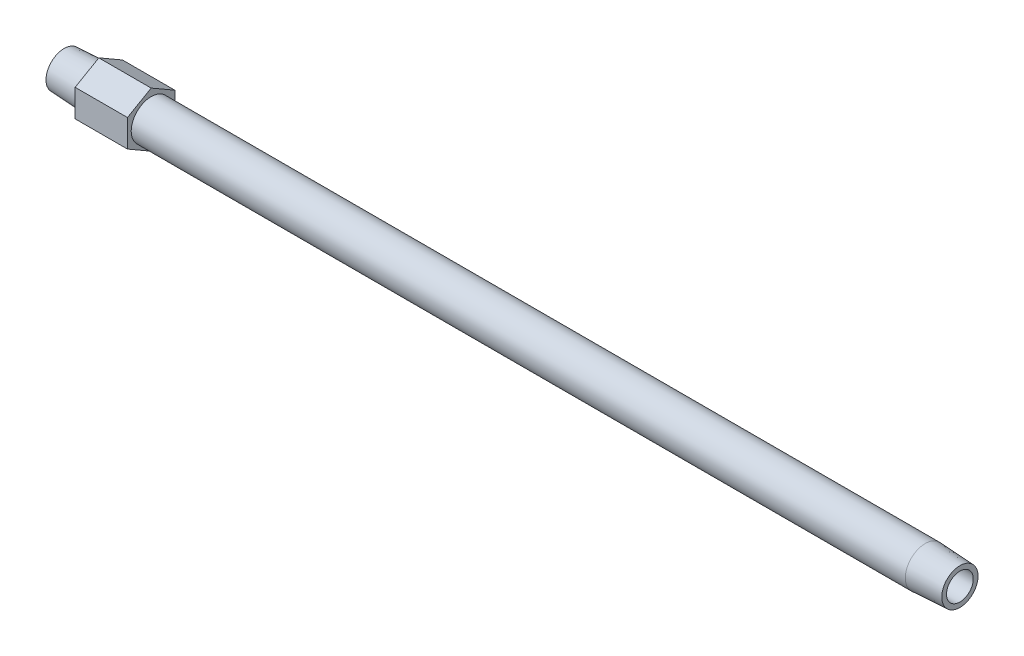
ISO-10303-21;
HEADER;
FILE_DESCRIPTION(('STEP AP214'),'2;1');
FILE_NAME('part.step','',(''),(''),'','','');
FILE_SCHEMA(('AUTOMOTIVE_DESIGN { 1 0 10303 214 1 1 1 1 }'));
ENDSEC;
DATA;
#1=APPLICATION_CONTEXT('core data for automotive mechanical design processes');
#2=APPLICATION_PROTOCOL_DEFINITION('international standard','automotive_design',2000,#1);
#3=PRODUCT_CONTEXT('',#1,'mechanical');
#4=PRODUCT('Part','Part','',(#3));
#5=PRODUCT_RELATED_PRODUCT_CATEGORY('part','',(#4));
#6=PRODUCT_DEFINITION_FORMATION('','',#4);
#7=PRODUCT_DEFINITION_CONTEXT('part definition',#1,'design');
#8=PRODUCT_DEFINITION('design','',#6,#7);
#9=PRODUCT_DEFINITION_SHAPE('','',#8);
#10=(LENGTH_UNIT() NAMED_UNIT(*) SI_UNIT(.MILLI.,.METRE.));
#11=(NAMED_UNIT(*) PLANE_ANGLE_UNIT() SI_UNIT($,.RADIAN.));
#12=(NAMED_UNIT(*) SI_UNIT($,.STERADIAN.) SOLID_ANGLE_UNIT());
#13=UNCERTAINTY_MEASURE_WITH_UNIT(LENGTH_MEASURE(1.E-05),#10,'distance_accuracy_value','');
#14=(GEOMETRIC_REPRESENTATION_CONTEXT(3) GLOBAL_UNCERTAINTY_ASSIGNED_CONTEXT((#13)) GLOBAL_UNIT_ASSIGNED_CONTEXT((#10,
#11,#12)) REPRESENTATION_CONTEXT('',''));
#15=CARTESIAN_POINT('',(0.,0.,0.));
#16=DIRECTION('',(0.,0.,1.));
#17=DIRECTION('',(1.,0.,0.));
#18=AXIS2_PLACEMENT_3D('',#15,#16,#17);
#19=CARTESIAN_POINT('',(0.,0.,-3.59899397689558));
#20=DIRECTION('',(1.,0.,0.));
#21=DIRECTION('',(0.,0.,-1.));
#22=AXIS2_PLACEMENT_3D('',#19,#20,#21);
#23=PLANE('',#22);
#24=CARTESIAN_POINT('',(0.,0.,0.));
#25=DIRECTION('',(-1.,0.,0.));
#26=DIRECTION('',(0.,0.,1.));
#27=AXIS2_PLACEMENT_3D('',#24,#25,#26);
#28=CIRCLE('',#27,3.59899397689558);
#29=CARTESIAN_POINT('',(0.,0.,3.59899397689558));
#30=VERTEX_POINT('',#29);
#31=EDGE_CURVE('E147',#30,#30,#28,.T.);
#32=ORIENTED_EDGE('',*,*,#31,.T.);
#33=EDGE_LOOP('',(#32));
#34=FACE_BOUND('',#33,.T.);
#35=CARTESIAN_POINT('',(0.,0.,0.));
#36=DIRECTION('',(1.,0.,0.));
#37=DIRECTION('',(0.,0.,1.));
#38=AXIS2_PLACEMENT_3D('',#35,#36,#37);
#39=CIRCLE('',#38,2.6543);
#40=CARTESIAN_POINT('',(0.,0.,2.6543));
#41=VERTEX_POINT('',#40);
#42=EDGE_CURVE('E159',#41,#41,#39,.T.);
#43=ORIENTED_EDGE('',*,*,#42,.T.);
#44=EDGE_LOOP('',(#43));
#45=FACE_BOUND('',#44,.T.);
#46=ADVANCED_FACE('F15',(#34,#45),#23,.F.);
#47=CARTESIAN_POINT('',(177.8,0.,-3.59899397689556));
#48=DIRECTION('',(-1.,0.,0.));
#49=DIRECTION('',(0.,0.,1.));
#50=AXIS2_PLACEMENT_3D('',#47,#48,#49);
#51=PLANE('',#50);
#52=CARTESIAN_POINT('',(177.8,0.,0.));
#53=DIRECTION('',(-1.,0.,0.));
#54=DIRECTION('',(0.,0.,1.));
#55=AXIS2_PLACEMENT_3D('',#52,#53,#54);
#56=CIRCLE('',#55,3.59899397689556);
#57=CARTESIAN_POINT('',(177.8,0.,3.59899397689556));
#58=VERTEX_POINT('',#57);
#59=EDGE_CURVE('E150',#58,#58,#56,.T.);
#60=ORIENTED_EDGE('',*,*,#59,.F.);
#61=EDGE_LOOP('',(#60));
#62=FACE_BOUND('',#61,.T.);
#63=CARTESIAN_POINT('',(177.8,0.,0.));
#64=DIRECTION('',(-1.,0.,0.));
#65=DIRECTION('',(0.,0.,1.));
#66=AXIS2_PLACEMENT_3D('',#63,#64,#65);
#67=CIRCLE('',#66,2.6543);
#68=CARTESIAN_POINT('',(177.8,0.,2.6543));
#69=VERTEX_POINT('',#68);
#70=EDGE_CURVE('E156',#69,#69,#67,.F.);
#71=ORIENTED_EDGE('',*,*,#70,.F.);
#72=EDGE_LOOP('',(#71));
#73=FACE_BOUND('',#72,.T.);
#74=ADVANCED_FACE('F178',(#62,#73),#51,.F.);
#75=CARTESIAN_POINT('',(17.272,-2.71296891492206,-4.699));
#76=DIRECTION('',(1.,0.,0.));
#77=DIRECTION('',(0.,1.,0.));
#78=AXIS2_PLACEMENT_3D('',#75,#76,#77);
#79=PLANE('',#78);
#80=DIRECTION('',(0.,0.5,-0.866025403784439));
#81=VECTOR('',#80,1.);
#82=CARTESIAN_POINT('',(17.272,-5.4259378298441,0.));
#83=LINE('',#82,#81);
#84=CARTESIAN_POINT('',(17.272,-5.4259378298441,0.));
#85=VERTEX_POINT('',#84);
#86=CARTESIAN_POINT('',(17.272,-2.71296891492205,-4.699));
#87=VERTEX_POINT('',#86);
#88=EDGE_CURVE('E103',#85,#87,#83,.T.);
#89=ORIENTED_EDGE('',*,*,#88,.T.);
#90=DIRECTION('',(0.,1.,0.));
#91=VECTOR('',#90,1.);
#92=CARTESIAN_POINT('',(17.272,-2.71296891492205,-4.699));
#93=LINE('',#92,#91);
#94=CARTESIAN_POINT('',(17.272,2.71296891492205,-4.699));
#95=VERTEX_POINT('',#94);
#96=EDGE_CURVE('E83',#87,#95,#93,.T.);
#97=ORIENTED_EDGE('',*,*,#96,.T.);
#98=DIRECTION('',(0.,0.5,0.866025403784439));
#99=VECTOR('',#98,1.);
#100=CARTESIAN_POINT('',(17.272,2.71296891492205,-4.699));
#101=LINE('',#100,#99);
#102=CARTESIAN_POINT('',(17.272,5.4259378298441,0.));
#103=VERTEX_POINT('',#102);
#104=EDGE_CURVE('E102',#95,#103,#101,.T.);
#105=ORIENTED_EDGE('',*,*,#104,.T.);
#106=DIRECTION('',(0.,-0.5,0.866025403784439));
#107=VECTOR('',#106,1.);
#108=CARTESIAN_POINT('',(17.272,5.4259378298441,0.));
#109=LINE('',#108,#107);
#110=CARTESIAN_POINT('',(17.272,2.71296891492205,4.699));
#111=VERTEX_POINT('',#110);
#112=EDGE_CURVE('E105',#103,#111,#109,.T.);
#113=ORIENTED_EDGE('',*,*,#112,.T.);
#114=DIRECTION('',(0.,-1.,0.));
#115=VECTOR('',#114,1.);
#116=CARTESIAN_POINT('',(17.272,2.71296891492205,4.699));
#117=LINE('',#116,#115);
#118=CARTESIAN_POINT('',(17.272,-2.71296891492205,4.699));
#119=VERTEX_POINT('',#118);
#120=EDGE_CURVE('E35',#111,#119,#117,.T.);
#121=ORIENTED_EDGE('',*,*,#120,.T.);
#122=DIRECTION('',(0.,-0.5,-0.866025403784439));
#123=VECTOR('',#122,1.);
#124=CARTESIAN_POINT('',(17.272,-2.71296891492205,4.699));
#125=LINE('',#124,#123);
#126=EDGE_CURVE('E30',#119,#85,#125,.T.);
#127=ORIENTED_EDGE('',*,*,#126,.T.);
#128=EDGE_LOOP('',(#89,#97,#105,#113,#121,#127));
#129=FACE_BOUND('',#128,.T.);
#130=CARTESIAN_POINT('',(17.272,0.,0.));
#131=DIRECTION('',(1.,0.,0.));
#132=DIRECTION('',(0.,1.,0.));
#133=AXIS2_PLACEMENT_3D('',#130,#131,#132);
#134=CIRCLE('',#133,3.95973768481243);
#135=CARTESIAN_POINT('',(17.272,3.95973768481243,0.));
#136=VERTEX_POINT('',#135);
#137=EDGE_CURVE('E89',#136,#136,#134,.F.);
#138=ORIENTED_EDGE('',*,*,#137,.T.);
#139=EDGE_LOOP('',(#138));
#140=FACE_BOUND('',#139,.T.);
#141=ADVANCED_FACE('F124',(#129,#140),#79,.T.);
#142=CARTESIAN_POINT('',(6.8834,-2.71296891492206,-4.699));
#143=DIRECTION('',(1.,0.,0.));
#144=DIRECTION('',(0.,1.,0.));
#145=AXIS2_PLACEMENT_3D('',#142,#143,#144);
#146=PLANE('',#145);
#147=DIRECTION('',(0.,0.5,-0.866025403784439));
#148=VECTOR('',#147,1.);
#149=CARTESIAN_POINT('',(6.8834,-5.4259378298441,0.));
#150=LINE('',#149,#148);
#151=CARTESIAN_POINT('',(6.8834,-5.4259378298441,0.));
#152=VERTEX_POINT('',#151);
#153=CARTESIAN_POINT('',(6.8834,-2.71296891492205,-4.699));
#154=VERTEX_POINT('',#153);
#155=EDGE_CURVE('E73',#152,#154,#150,.T.);
#156=ORIENTED_EDGE('',*,*,#155,.F.);
#157=DIRECTION('',(0.,-0.5,-0.866025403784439));
#158=VECTOR('',#157,1.);
#159=CARTESIAN_POINT('',(6.8834,-2.71296891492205,4.699));
#160=LINE('',#159,#158);
#161=CARTESIAN_POINT('',(6.8834,-2.71296891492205,4.699));
#162=VERTEX_POINT('',#161);
#163=EDGE_CURVE('E99',#162,#152,#160,.T.);
#164=ORIENTED_EDGE('',*,*,#163,.F.);
#165=DIRECTION('',(0.,-1.,0.));
#166=VECTOR('',#165,1.);
#167=CARTESIAN_POINT('',(6.8834,2.71296891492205,4.699));
#168=LINE('',#167,#166);
#169=CARTESIAN_POINT('',(6.8834,2.71296891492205,4.699));
#170=VERTEX_POINT('',#169);
#171=EDGE_CURVE('E133',#170,#162,#168,.T.);
#172=ORIENTED_EDGE('',*,*,#171,.F.);
#173=DIRECTION('',(0.,-0.5,0.866025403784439));
#174=VECTOR('',#173,1.);
#175=CARTESIAN_POINT('',(6.8834,5.4259378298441,0.));
#176=LINE('',#175,#174);
#177=CARTESIAN_POINT('',(6.8834,5.4259378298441,0.));
#178=VERTEX_POINT('',#177);
#179=EDGE_CURVE('E129',#178,#170,#176,.T.);
#180=ORIENTED_EDGE('',*,*,#179,.F.);
#181=DIRECTION('',(0.,0.5,0.866025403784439));
#182=VECTOR('',#181,1.);
#183=CARTESIAN_POINT('',(6.8834,2.71296891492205,-4.699));
#184=LINE('',#183,#182);
#185=CARTESIAN_POINT('',(6.8834,2.71296891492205,-4.699));
#186=VERTEX_POINT('',#185);
#187=EDGE_CURVE('E75',#186,#178,#184,.T.);
#188=ORIENTED_EDGE('',*,*,#187,.F.);
#189=DIRECTION('',(0.,1.,0.));
#190=VECTOR('',#189,1.);
#191=CARTESIAN_POINT('',(6.8834,-2.71296891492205,-4.699));
#192=LINE('',#191,#190);
#193=EDGE_CURVE('E68',#154,#186,#192,.T.);
#194=ORIENTED_EDGE('',*,*,#193,.F.);
#195=EDGE_LOOP('',(#156,#164,#172,#180,#188,#194));
#196=FACE_BOUND('',#195,.T.);
#197=CARTESIAN_POINT('',(6.8834,0.,0.));
#198=DIRECTION('',(-1.,0.,0.));
#199=DIRECTION('',(0.,0.,1.));
#200=AXIS2_PLACEMENT_3D('',#197,#198,#199);
#201=CIRCLE('',#200,3.95973768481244);
#202=CARTESIAN_POINT('',(6.8834,0.,3.95973768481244));
#203=VERTEX_POINT('',#202);
#204=EDGE_CURVE('E95',#203,#203,#201,.T.);
#205=ORIENTED_EDGE('',*,*,#204,.F.);
#206=EDGE_LOOP('',(#205));
#207=FACE_BOUND('',#206,.T.);
#208=ADVANCED_FACE('F69',(#196,#207),#146,.F.);
#209=CARTESIAN_POINT('',(17.272,-5.4259378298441,0.));
#210=DIRECTION('',(0.,0.866025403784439,0.5));
#211=DIRECTION('',(0.,-0.5,0.866025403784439));
#212=AXIS2_PLACEMENT_3D('',#209,#210,#211);
#213=PLANE('',#212);
#214=ORIENTED_EDGE('',*,*,#155,.T.);
#215=DIRECTION('',(-1.,0.,0.));
#216=VECTOR('',#215,1.);
#217=CARTESIAN_POINT('',(17.272,-2.71296891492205,-4.699));
#218=LINE('',#217,#216);
#219=EDGE_CURVE('E10',#87,#154,#218,.T.);
#220=ORIENTED_EDGE('',*,*,#219,.F.);
#221=ORIENTED_EDGE('',*,*,#88,.F.);
#222=DIRECTION('',(-1.,0.,0.));
#223=VECTOR('',#222,1.);
#224=CARTESIAN_POINT('',(17.272,-5.4259378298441,0.));
#225=LINE('',#224,#223);
#226=EDGE_CURVE('E87',#85,#152,#225,.T.);
#227=ORIENTED_EDGE('',*,*,#226,.T.);
#228=EDGE_LOOP('',(#214,#220,#221,#227));
#229=FACE_BOUND('',#228,.T.);
#230=ADVANCED_FACE('F17',(#229),#213,.F.);
#231=CARTESIAN_POINT('',(17.272,-2.71296891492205,-4.699));
#232=DIRECTION('',(0.,0.,1.));
#233=DIRECTION('',(1.,0.,0.));
#234=AXIS2_PLACEMENT_3D('',#231,#232,#233);
#235=PLANE('',#234);
#236=ORIENTED_EDGE('',*,*,#193,.T.);
#237=DIRECTION('',(-1.,0.,0.));
#238=VECTOR('',#237,1.);
#239=CARTESIAN_POINT('',(17.272,2.71296891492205,-4.699));
#240=LINE('',#239,#238);
#241=EDGE_CURVE('E23',#95,#186,#240,.T.);
#242=ORIENTED_EDGE('',*,*,#241,.F.);
#243=ORIENTED_EDGE('',*,*,#96,.F.);
#244=ORIENTED_EDGE('',*,*,#219,.T.);
#245=EDGE_LOOP('',(#236,#242,#243,#244));
#246=FACE_BOUND('',#245,.T.);
#247=ADVANCED_FACE('F82',(#246),#235,.F.);
#248=CARTESIAN_POINT('',(17.272,2.71296891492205,-4.699));
#249=DIRECTION('',(0.,-0.866025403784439,0.5));
#250=DIRECTION('',(0.,-0.5,-0.866025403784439));
#251=AXIS2_PLACEMENT_3D('',#248,#249,#250);
#252=PLANE('',#251);
#253=ORIENTED_EDGE('',*,*,#187,.T.);
#254=DIRECTION('',(-1.,0.,0.));
#255=VECTOR('',#254,1.);
#256=CARTESIAN_POINT('',(17.272,5.4259378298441,0.));
#257=LINE('',#256,#255);
#258=EDGE_CURVE('E117',#103,#178,#257,.T.);
#259=ORIENTED_EDGE('',*,*,#258,.F.);
#260=ORIENTED_EDGE('',*,*,#104,.F.);
#261=ORIENTED_EDGE('',*,*,#241,.T.);
#262=EDGE_LOOP('',(#253,#259,#260,#261));
#263=FACE_BOUND('',#262,.T.);
#264=ADVANCED_FACE('F121',(#263),#252,.F.);
#265=CARTESIAN_POINT('',(17.272,5.4259378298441,0.));
#266=DIRECTION('',(0.,-0.866025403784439,-0.5));
#267=DIRECTION('',(0.,0.5,-0.866025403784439));
#268=AXIS2_PLACEMENT_3D('',#265,#266,#267);
#269=PLANE('',#268);
#270=ORIENTED_EDGE('',*,*,#179,.T.);
#271=DIRECTION('',(-1.,0.,0.));
#272=VECTOR('',#271,1.);
#273=CARTESIAN_POINT('',(17.272,2.71296891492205,4.699));
#274=LINE('',#273,#272);
#275=EDGE_CURVE('E114',#111,#170,#274,.T.);
#276=ORIENTED_EDGE('',*,*,#275,.F.);
#277=ORIENTED_EDGE('',*,*,#112,.F.);
#278=ORIENTED_EDGE('',*,*,#258,.T.);
#279=EDGE_LOOP('',(#270,#276,#277,#278));
#280=FACE_BOUND('',#279,.T.);
#281=ADVANCED_FACE('F128',(#280),#269,.F.);
#282=CARTESIAN_POINT('',(17.272,2.71296891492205,4.699));
#283=DIRECTION('',(0.,0.,-1.));
#284=DIRECTION('',(-1.,0.,0.));
#285=AXIS2_PLACEMENT_3D('',#282,#283,#284);
#286=PLANE('',#285);
#287=ORIENTED_EDGE('',*,*,#171,.T.);
#288=DIRECTION('',(-1.,0.,0.));
#289=VECTOR('',#288,1.);
#290=CARTESIAN_POINT('',(17.272,-2.71296891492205,4.699));
#291=LINE('',#290,#289);
#292=EDGE_CURVE('E111',#119,#162,#291,.T.);
#293=ORIENTED_EDGE('',*,*,#292,.F.);
#294=ORIENTED_EDGE('',*,*,#120,.F.);
#295=ORIENTED_EDGE('',*,*,#275,.T.);
#296=EDGE_LOOP('',(#287,#293,#294,#295));
#297=FACE_BOUND('',#296,.T.);
#298=ADVANCED_FACE('F132',(#297),#286,.F.);
#299=CARTESIAN_POINT('',(17.272,-2.71296891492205,4.699));
#300=DIRECTION('',(0.,0.866025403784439,-0.5));
#301=DIRECTION('',(0.,0.5,0.866025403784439));
#302=AXIS2_PLACEMENT_3D('',#299,#300,#301);
#303=PLANE('',#302);
#304=ORIENTED_EDGE('',*,*,#163,.T.);
#305=ORIENTED_EDGE('',*,*,#226,.F.);
#306=ORIENTED_EDGE('',*,*,#126,.F.);
#307=ORIENTED_EDGE('',*,*,#292,.T.);
#308=EDGE_LOOP('',(#304,#305,#306,#307));
#309=FACE_BOUND('',#308,.T.);
#310=ADVANCED_FACE('F135',(#309),#303,.F.);
#311=CARTESIAN_POINT('',(6.8834,0.,0.));
#312=DIRECTION('',(1.,0.,0.));
#313=DIRECTION('',(0.,0.,-1.));
#314=AXIS2_PLACEMENT_3D('',#311,#312,#313);
#315=CONICAL_SURFACE('',#314,3.95973768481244,0.0523598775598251);
#316=ORIENTED_EDGE('',*,*,#31,.F.);
#317=EDGE_LOOP('',(#316));
#318=FACE_BOUND('',#317,.T.);
#319=ORIENTED_EDGE('',*,*,#204,.T.);
#320=EDGE_LOOP('',(#319));
#321=FACE_BOUND('',#320,.T.);
#322=ADVANCED_FACE('F187',(#318,#321),#315,.T.);
#323=CARTESIAN_POINT('',(-60.,0.,0.));
#324=DIRECTION('',(-1.,0.,0.));
#325=DIRECTION('',(0.,0.,1.));
#326=AXIS2_PLACEMENT_3D('',#323,#324,#325);
#327=CYLINDRICAL_SURFACE('',#326,3.95973768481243);
#328=ORIENTED_EDGE('',*,*,#137,.F.);
#329=EDGE_LOOP('',(#328));
#330=FACE_BOUND('',#329,.T.);
#331=CARTESIAN_POINT('',(170.9166,0.,0.));
#332=DIRECTION('',(-1.,0.,0.));
#333=DIRECTION('',(0.,0.,1.));
#334=AXIS2_PLACEMENT_3D('',#331,#332,#333);
#335=CIRCLE('',#334,3.95973768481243);
#336=CARTESIAN_POINT('',(170.9166,0.,3.95973768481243));
#337=VERTEX_POINT('',#336);
#338=EDGE_CURVE('E153',#337,#337,#335,.T.);
#339=ORIENTED_EDGE('',*,*,#338,.T.);
#340=EDGE_LOOP('',(#339));
#341=FACE_BOUND('',#340,.T.);
#342=ADVANCED_FACE('F174',(#330,#341),#327,.T.);
#343=CARTESIAN_POINT('',(177.8,0.,0.));
#344=DIRECTION('',(-1.,0.,0.));
#345=DIRECTION('',(0.,0.,1.));
#346=AXIS2_PLACEMENT_3D('',#343,#344,#345);
#347=CONICAL_SURFACE('',#346,3.59899397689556,0.0523598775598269);
#348=ORIENTED_EDGE('',*,*,#338,.F.);
#349=EDGE_LOOP('',(#348));
#350=FACE_BOUND('',#349,.T.);
#351=ORIENTED_EDGE('',*,*,#59,.T.);
#352=EDGE_LOOP('',(#351));
#353=FACE_BOUND('',#352,.T.);
#354=ADVANCED_FACE('F167',(#350,#353),#347,.T.);
#355=CARTESIAN_POINT('',(178.378601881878,0.,0.));
#356=DIRECTION('',(-1.,0.,0.));
#357=DIRECTION('',(0.,0.,1.));
#358=AXIS2_PLACEMENT_3D('',#355,#356,#357);
#359=CYLINDRICAL_SURFACE('',#358,2.6543);
#360=ORIENTED_EDGE('',*,*,#70,.T.);
#361=EDGE_LOOP('',(#360));
#362=FACE_BOUND('',#361,.T.);
#363=ORIENTED_EDGE('',*,*,#42,.F.);
#364=EDGE_LOOP('',(#363));
#365=FACE_BOUND('',#364,.T.);
#366=ADVANCED_FACE('F165',(#362,#365),#359,.F.);
#367=CLOSED_SHELL('',(#46,#74,#141,#208,#230,#247,#264,#281,#298,#310,#322,#342,#354,#366));
#368=MANIFOLD_SOLID_BREP('B1',#367);
#369=ADVANCED_BREP_SHAPE_REPRESENTATION('',(#18,#368),#14);
#370=SHAPE_DEFINITION_REPRESENTATION(#9,#369);
ENDSEC;
END-ISO-10303-21;
